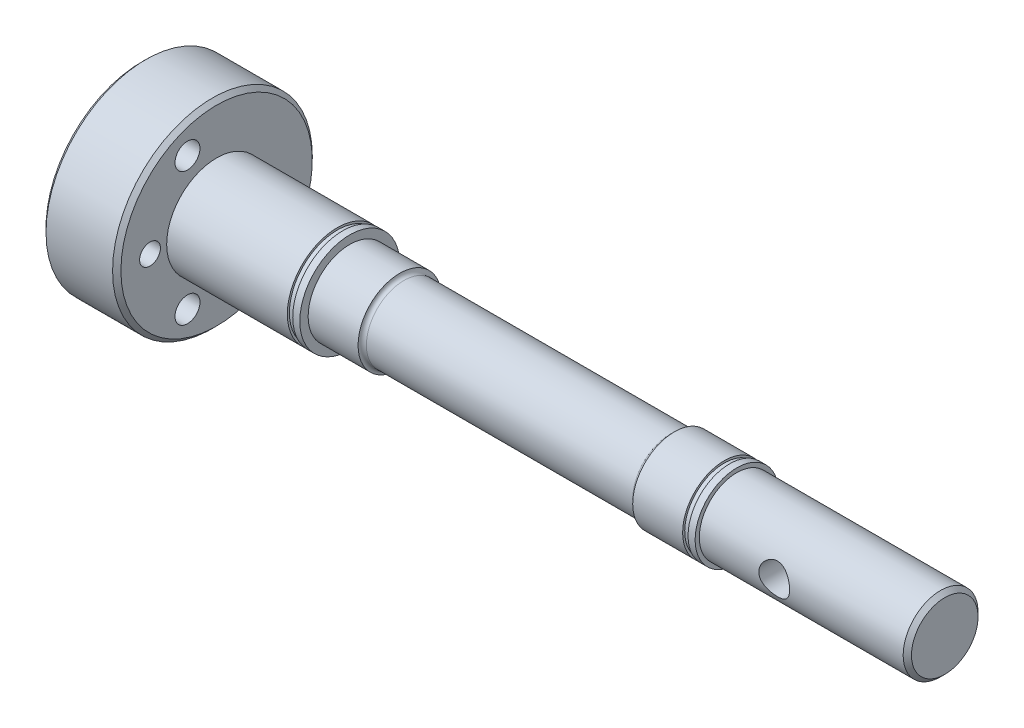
ISO-10303-21;
HEADER;
FILE_DESCRIPTION(('STEP AP214'),'2;1');
FILE_NAME('part.step','',(''),(''),'','','');
FILE_SCHEMA(('AUTOMOTIVE_DESIGN { 1 0 10303 214 1 1 1 1 }'));
ENDSEC;
DATA;
#1=APPLICATION_CONTEXT('core data for automotive mechanical design processes');
#2=APPLICATION_PROTOCOL_DEFINITION('international standard','automotive_design',2000,#1);
#3=PRODUCT_CONTEXT('',#1,'mechanical');
#4=PRODUCT('Part','Part','',(#3));
#5=PRODUCT_RELATED_PRODUCT_CATEGORY('part','',(#4));
#6=PRODUCT_DEFINITION_FORMATION('','',#4);
#7=PRODUCT_DEFINITION_CONTEXT('part definition',#1,'design');
#8=PRODUCT_DEFINITION('design','',#6,#7);
#9=PRODUCT_DEFINITION_SHAPE('','',#8);
#10=(LENGTH_UNIT() NAMED_UNIT(*) SI_UNIT(.MILLI.,.METRE.));
#11=(NAMED_UNIT(*) PLANE_ANGLE_UNIT() SI_UNIT($,.RADIAN.));
#12=(NAMED_UNIT(*) SI_UNIT($,.STERADIAN.) SOLID_ANGLE_UNIT());
#13=UNCERTAINTY_MEASURE_WITH_UNIT(LENGTH_MEASURE(1.E-05),#10,'distance_accuracy_value','');
#14=(GEOMETRIC_REPRESENTATION_CONTEXT(3) GLOBAL_UNCERTAINTY_ASSIGNED_CONTEXT((#13)) GLOBAL_UNIT_ASSIGNED_CONTEXT((#10,
#11,#12)) REPRESENTATION_CONTEXT('',''));
#15=CARTESIAN_POINT('',(0.,0.,0.));
#16=DIRECTION('',(0.,0.,1.));
#17=DIRECTION('',(1.,0.,0.));
#18=AXIS2_PLACEMENT_3D('',#15,#16,#17);
#19=CARTESIAN_POINT('',(-48.7717201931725,0.,0.));
#20=DIRECTION('',(-1.,0.,0.));
#21=DIRECTION('',(0.,0.,1.));
#22=AXIS2_PLACEMENT_3D('',#19,#20,#21);
#23=CYLINDRICAL_SURFACE('',#22,9.99999999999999);
#24=CARTESIAN_POINT('',(128.,0.,0.));
#25=DIRECTION('',(-1.,0.,0.));
#26=DIRECTION('',(0.,0.,1.));
#27=AXIS2_PLACEMENT_3D('',#24,#25,#26);
#28=CIRCLE('',#27,9.99999999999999);
#29=CARTESIAN_POINT('',(128.,0.,9.99999999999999));
#30=VERTEX_POINT('',#29);
#31=EDGE_CURVE('E184',#30,#30,#28,.T.);
#32=ORIENTED_EDGE('',*,*,#31,.F.);
#33=EDGE_LOOP('',(#32));
#34=FACE_BOUND('',#33,.T.);
#35=CARTESIAN_POINT('',(140.,0.,0.));
#36=DIRECTION('',(-1.,0.,0.));
#37=DIRECTION('',(0.,-1.,0.));
#38=AXIS2_PLACEMENT_3D('',#35,#36,#37);
#39=CIRCLE('',#38,9.99999999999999);
#40=CARTESIAN_POINT('',(140.,-9.99999999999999,0.));
#41=VERTEX_POINT('',#40);
#42=EDGE_CURVE('E148',#41,#41,#39,.T.);
#43=ORIENTED_EDGE('',*,*,#42,.T.);
#44=EDGE_LOOP('',(#43));
#45=FACE_BOUND('',#44,.T.);
#46=ADVANCED_FACE('F30',(#34,#45),#23,.T.);
#47=CARTESIAN_POINT('',(-48.7717201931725,0.,0.));
#48=DIRECTION('',(-1.,0.,0.));
#49=DIRECTION('',(0.,0.,1.));
#50=AXIS2_PLACEMENT_3D('',#47,#48,#49);
#51=CYLINDRICAL_SURFACE('',#50,12.);
#52=CARTESIAN_POINT('',(50.,0.,0.));
#53=DIRECTION('',(-1.,0.,0.));
#54=DIRECTION('',(0.,0.,1.));
#55=AXIS2_PLACEMENT_3D('',#52,#53,#54);
#56=CIRCLE('',#55,12.);
#57=CARTESIAN_POINT('',(50.,0.,12.));
#58=VERTEX_POINT('',#57);
#59=EDGE_CURVE('E193',#58,#58,#56,.T.);
#60=ORIENTED_EDGE('',*,*,#59,.T.);
#61=EDGE_LOOP('',(#60));
#62=FACE_BOUND('',#61,.T.);
#63=CARTESIAN_POINT('',(48.3,0.,0.));
#64=DIRECTION('',(-1.,0.,0.));
#65=DIRECTION('',(0.,0.,1.));
#66=AXIS2_PLACEMENT_3D('',#63,#64,#65);
#67=CIRCLE('',#66,12.);
#68=CARTESIAN_POINT('',(48.3,0.,12.));
#69=VERTEX_POINT('',#68);
#70=EDGE_CURVE('E174',#69,#69,#67,.T.);
#71=ORIENTED_EDGE('',*,*,#70,.F.);
#72=EDGE_LOOP('',(#71));
#73=FACE_BOUND('',#72,.T.);
#74=ADVANCED_FACE('F120',(#62,#73),#51,.T.);
#75=CARTESIAN_POINT('',(50.,12.,0.));
#76=DIRECTION('',(-1.,0.,0.));
#77=DIRECTION('',(0.,0.,1.));
#78=AXIS2_PLACEMENT_3D('',#75,#76,#77);
#79=PLANE('',#78);
#80=ORIENTED_EDGE('',*,*,#59,.F.);
#81=EDGE_LOOP('',(#80));
#82=FACE_BOUND('',#81,.T.);
#83=CARTESIAN_POINT('',(50.,0.,0.));
#84=DIRECTION('',(-1.,0.,0.));
#85=DIRECTION('',(0.,0.,1.));
#86=AXIS2_PLACEMENT_3D('',#83,#84,#85);
#87=CIRCLE('',#86,9.99999999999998);
#88=CARTESIAN_POINT('',(50.,0.,9.99999999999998));
#89=VERTEX_POINT('',#88);
#90=EDGE_CURVE('E190',#89,#89,#87,.T.);
#91=ORIENTED_EDGE('',*,*,#90,.T.);
#92=EDGE_LOOP('',(#91));
#93=FACE_BOUND('',#92,.T.);
#94=ADVANCED_FACE('F127',(#82,#93),#79,.F.);
#95=CARTESIAN_POINT('',(-48.7717201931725,0.,0.));
#96=DIRECTION('',(-1.,0.,0.));
#97=DIRECTION('',(0.,0.,1.));
#98=AXIS2_PLACEMENT_3D('',#95,#96,#97);
#99=CYLINDRICAL_SURFACE('',#98,9.99999999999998);
#100=ORIENTED_EDGE('',*,*,#90,.F.);
#101=EDGE_LOOP('',(#100));
#102=FACE_BOUND('',#101,.T.);
#103=CARTESIAN_POINT('',(62.,0.,0.));
#104=DIRECTION('',(-1.,0.,0.));
#105=DIRECTION('',(0.,0.,1.));
#106=AXIS2_PLACEMENT_3D('',#103,#104,#105);
#107=CIRCLE('',#106,9.99999999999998);
#108=CARTESIAN_POINT('',(62.,0.,9.99999999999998));
#109=VERTEX_POINT('',#108);
#110=EDGE_CURVE('E187',#109,#109,#107,.T.);
#111=ORIENTED_EDGE('',*,*,#110,.T.);
#112=EDGE_LOOP('',(#111));
#113=FACE_BOUND('',#112,.T.);
#114=ADVANCED_FACE('F346',(#102,#113),#99,.T.);
#115=CARTESIAN_POINT('',(-48.7717201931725,0.,0.));
#116=DIRECTION('',(-1.,0.,0.));
#117=DIRECTION('',(0.,0.,1.));
#118=AXIS2_PLACEMENT_3D('',#115,#116,#117);
#119=CYLINDRICAL_SURFACE('',#118,8.99999999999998);
#120=CARTESIAN_POINT('',(127.,0.,0.));
#121=DIRECTION('',(1.,0.,0.));
#122=DIRECTION('',(0.,0.,-1.));
#123=AXIS2_PLACEMENT_3D('',#120,#121,#122);
#124=CIRCLE('',#123,8.99999999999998);
#125=CARTESIAN_POINT('',(127.,0.,-8.99999999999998));
#126=VERTEX_POINT('',#125);
#127=EDGE_CURVE('E202',#126,#126,#124,.F.);
#128=ORIENTED_EDGE('',*,*,#127,.T.);
#129=EDGE_LOOP('',(#128));
#130=FACE_BOUND('',#129,.T.);
#131=CARTESIAN_POINT('',(63.,0.,0.));
#132=DIRECTION('',(-1.,0.,0.));
#133=DIRECTION('',(0.,0.,1.));
#134=AXIS2_PLACEMENT_3D('',#131,#132,#133);
#135=CIRCLE('',#134,8.99999999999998);
#136=CARTESIAN_POINT('',(63.,0.,8.99999999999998));
#137=VERTEX_POINT('',#136);
#138=EDGE_CURVE('E199',#137,#137,#135,.F.);
#139=ORIENTED_EDGE('',*,*,#138,.T.);
#140=EDGE_LOOP('',(#139));
#141=FACE_BOUND('',#140,.T.);
#142=ADVANCED_FACE('F106',(#130,#141),#119,.T.);
#143=CARTESIAN_POINT('',(47.,11.5,0.));
#144=DIRECTION('',(1.,0.,0.));
#145=DIRECTION('',(0.,0.,-1.));
#146=AXIS2_PLACEMENT_3D('',#143,#144,#145);
#147=PLANE('',#146);
#148=CARTESIAN_POINT('',(47.,0.,0.));
#149=DIRECTION('',(-1.,0.,0.));
#150=DIRECTION('',(0.,0.,1.));
#151=AXIS2_PLACEMENT_3D('',#148,#149,#150);
#152=CIRCLE('',#151,11.5);
#153=CARTESIAN_POINT('',(47.,0.,11.5));
#154=VERTEX_POINT('',#153);
#155=EDGE_CURVE('E168',#154,#154,#152,.T.);
#156=ORIENTED_EDGE('',*,*,#155,.T.);
#157=EDGE_LOOP('',(#156));
#158=FACE_BOUND('',#157,.T.);
#159=CARTESIAN_POINT('',(47.,0.,0.));
#160=DIRECTION('',(-1.,0.,0.));
#161=DIRECTION('',(0.,0.,1.));
#162=AXIS2_PLACEMENT_3D('',#159,#160,#161);
#163=CIRCLE('',#162,12.);
#164=CARTESIAN_POINT('',(47.,0.,12.));
#165=VERTEX_POINT('',#164);
#166=EDGE_CURVE('E177',#165,#165,#163,.T.);
#167=ORIENTED_EDGE('',*,*,#166,.F.);
#168=EDGE_LOOP('',(#167));
#169=FACE_BOUND('',#168,.T.);
#170=ADVANCED_FACE('F102',(#158,#169),#147,.T.);
#171=CARTESIAN_POINT('',(48.3,11.5,0.));
#172=DIRECTION('',(-1.,0.,0.));
#173=DIRECTION('',(0.,0.,1.));
#174=AXIS2_PLACEMENT_3D('',#171,#172,#173);
#175=PLANE('',#174);
#176=ORIENTED_EDGE('',*,*,#70,.T.);
#177=EDGE_LOOP('',(#176));
#178=FACE_BOUND('',#177,.T.);
#179=CARTESIAN_POINT('',(48.3,0.,0.));
#180=DIRECTION('',(-1.,0.,0.));
#181=DIRECTION('',(0.,0.,1.));
#182=AXIS2_PLACEMENT_3D('',#179,#180,#181);
#183=CIRCLE('',#182,11.5);
#184=CARTESIAN_POINT('',(48.3,0.,11.5));
#185=VERTEX_POINT('',#184);
#186=EDGE_CURVE('E171',#185,#185,#183,.T.);
#187=ORIENTED_EDGE('',*,*,#186,.F.);
#188=EDGE_LOOP('',(#187));
#189=FACE_BOUND('',#188,.T.);
#190=ADVANCED_FACE('F98',(#178,#189),#175,.T.);
#191=CARTESIAN_POINT('',(0.,0.,0.));
#192=DIRECTION('',(-1.,0.,0.));
#193=DIRECTION('',(0.,0.,1.));
#194=AXIS2_PLACEMENT_3D('',#191,#192,#193);
#195=CYLINDRICAL_SURFACE('',#194,11.5);
#196=ORIENTED_EDGE('',*,*,#186,.T.);
#197=EDGE_LOOP('',(#196));
#198=FACE_BOUND('',#197,.T.);
#199=ORIENTED_EDGE('',*,*,#155,.F.);
#200=EDGE_LOOP('',(#199));
#201=FACE_BOUND('',#200,.T.);
#202=ADVANCED_FACE('F94',(#198,#201),#195,.T.);
#203=CARTESIAN_POINT('',(0.,0.,0.));
#204=DIRECTION('',(1.,0.,0.));
#205=DIRECTION('',(0.,0.,-1.));
#206=AXIS2_PLACEMENT_3D('',#203,#204,#205);
#207=PLANE('',#206);
#208=CARTESIAN_POINT('',(0.,0.,16.));
#209=DIRECTION('',(-1.,0.,0.));
#210=DIRECTION('',(0.,0.,1.));
#211=AXIS2_PLACEMENT_3D('',#208,#209,#210);
#212=CIRCLE('',#211,2.5);
#213=CARTESIAN_POINT('',(0.,0.,18.5));
#214=VERTEX_POINT('',#213);
#215=EDGE_CURVE('E152',#214,#214,#212,.T.);
#216=ORIENTED_EDGE('',*,*,#215,.F.);
#217=EDGE_LOOP('',(#216));
#218=FACE_BOUND('',#217,.T.);
#219=CARTESIAN_POINT('',(0.,-16.,7.));
#220=DIRECTION('',(-1.,0.,0.));
#221=DIRECTION('',(0.,0.,1.));
#222=AXIS2_PLACEMENT_3D('',#219,#220,#221);
#223=CIRCLE('',#222,3.);
#224=CARTESIAN_POINT('',(0.,-16.,10.));
#225=VERTEX_POINT('',#224);
#226=EDGE_CURVE('E161',#225,#225,#223,.T.);
#227=ORIENTED_EDGE('',*,*,#226,.F.);
#228=EDGE_LOOP('',(#227));
#229=FACE_BOUND('',#228,.T.);
#230=CARTESIAN_POINT('',(0.,16.,7.));
#231=DIRECTION('',(-1.,0.,0.));
#232=DIRECTION('',(0.,0.,1.));
#233=AXIS2_PLACEMENT_3D('',#230,#231,#232);
#234=CIRCLE('',#233,3.);
#235=CARTESIAN_POINT('',(0.,16.,10.));
#236=VERTEX_POINT('',#235);
#237=EDGE_CURVE('E165',#236,#236,#234,.T.);
#238=ORIENTED_EDGE('',*,*,#237,.F.);
#239=EDGE_LOOP('',(#238));
#240=FACE_BOUND('',#239,.T.);
#241=CARTESIAN_POINT('',(0.,0.,0.));
#242=DIRECTION('',(1.,0.,0.));
#243=DIRECTION('',(0.,0.,-1.));
#244=AXIS2_PLACEMENT_3D('',#241,#242,#243);
#245=CIRCLE('',#244,23.);
#246=CARTESIAN_POINT('',(0.,0.,-23.));
#247=VERTEX_POINT('',#246);
#248=EDGE_CURVE('E10',#247,#247,#245,.F.);
#249=ORIENTED_EDGE('',*,*,#248,.T.);
#250=EDGE_LOOP('',(#249));
#251=FACE_BOUND('',#250,.T.);
#252=ADVANCED_FACE('F97',(#218,#229,#240,#251),#207,.F.);
#253=CARTESIAN_POINT('',(-48.7717201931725,0.,0.));
#254=DIRECTION('',(-1.,0.,0.));
#255=DIRECTION('',(0.,0.,1.));
#256=AXIS2_PLACEMENT_3D('',#253,#254,#255);
#257=CYLINDRICAL_SURFACE('',#256,24.);
#258=CARTESIAN_POINT('',(17.,0.,0.));
#259=DIRECTION('',(-1.,0.,0.));
#260=DIRECTION('',(0.,0.,1.));
#261=AXIS2_PLACEMENT_3D('',#258,#259,#260);
#262=CIRCLE('',#261,24.);
#263=CARTESIAN_POINT('',(17.,0.,24.));
#264=VERTEX_POINT('',#263);
#265=EDGE_CURVE('E208',#264,#264,#262,.T.);
#266=ORIENTED_EDGE('',*,*,#265,.T.);
#267=EDGE_LOOP('',(#266));
#268=FACE_BOUND('',#267,.T.);
#269=CARTESIAN_POINT('',(1.00000000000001,0.,0.));
#270=DIRECTION('',(1.,0.,0.));
#271=DIRECTION('',(0.,0.,-1.));
#272=AXIS2_PLACEMENT_3D('',#269,#270,#271);
#273=CIRCLE('',#272,24.);
#274=CARTESIAN_POINT('',(1.00000000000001,0.,-24.));
#275=VERTEX_POINT('',#274);
#276=EDGE_CURVE('E205',#275,#275,#273,.T.);
#277=ORIENTED_EDGE('',*,*,#276,.T.);
#278=EDGE_LOOP('',(#277));
#279=FACE_BOUND('',#278,.T.);
#280=ADVANCED_FACE('F32',(#268,#279),#257,.T.);
#281=CARTESIAN_POINT('',(18.,24.,0.));
#282=DIRECTION('',(-1.,0.,0.));
#283=DIRECTION('',(0.,0.,1.));
#284=AXIS2_PLACEMENT_3D('',#281,#282,#283);
#285=PLANE('',#284);
#286=CARTESIAN_POINT('',(18.,0.,16.));
#287=DIRECTION('',(-1.,0.,0.));
#288=DIRECTION('',(0.,0.,1.));
#289=AXIS2_PLACEMENT_3D('',#286,#287,#288);
#290=CIRCLE('',#289,2.5);
#291=CARTESIAN_POINT('',(18.,0.,18.5));
#292=VERTEX_POINT('',#291);
#293=EDGE_CURVE('E34',#292,#292,#290,.T.);
#294=ORIENTED_EDGE('',*,*,#293,.T.);
#295=EDGE_LOOP('',(#294));
#296=FACE_BOUND('',#295,.T.);
#297=CARTESIAN_POINT('',(18.,-16.,7.));
#298=DIRECTION('',(-1.,0.,0.));
#299=DIRECTION('',(0.,0.,1.));
#300=AXIS2_PLACEMENT_3D('',#297,#298,#299);
#301=CIRCLE('',#300,3.);
#302=CARTESIAN_POINT('',(18.,-16.,10.));
#303=VERTEX_POINT('',#302);
#304=EDGE_CURVE('E164',#303,#303,#301,.T.);
#305=ORIENTED_EDGE('',*,*,#304,.T.);
#306=EDGE_LOOP('',(#305));
#307=FACE_BOUND('',#306,.T.);
#308=CARTESIAN_POINT('',(18.,16.,7.));
#309=DIRECTION('',(-1.,0.,0.));
#310=DIRECTION('',(0.,0.,1.));
#311=AXIS2_PLACEMENT_3D('',#308,#309,#310);
#312=CIRCLE('',#311,3.);
#313=CARTESIAN_POINT('',(18.,16.,10.));
#314=VERTEX_POINT('',#313);
#315=EDGE_CURVE('E55',#314,#314,#312,.T.);
#316=ORIENTED_EDGE('',*,*,#315,.T.);
#317=EDGE_LOOP('',(#316));
#318=FACE_BOUND('',#317,.T.);
#319=CARTESIAN_POINT('',(18.,0.,0.));
#320=DIRECTION('',(-1.,0.,0.));
#321=DIRECTION('',(0.,0.,1.));
#322=AXIS2_PLACEMENT_3D('',#319,#320,#321);
#323=CIRCLE('',#322,23.);
#324=CARTESIAN_POINT('',(18.,0.,23.));
#325=VERTEX_POINT('',#324);
#326=EDGE_CURVE('E211',#325,#325,#323,.F.);
#327=ORIENTED_EDGE('',*,*,#326,.T.);
#328=EDGE_LOOP('',(#327));
#329=FACE_BOUND('',#328,.T.);
#330=CARTESIAN_POINT('',(18.,0.,0.));
#331=DIRECTION('',(-1.,0.,0.));
#332=DIRECTION('',(0.,0.,1.));
#333=AXIS2_PLACEMENT_3D('',#330,#331,#332);
#334=CIRCLE('',#333,12.);
#335=CARTESIAN_POINT('',(18.,0.,12.));
#336=VERTEX_POINT('',#335);
#337=EDGE_CURVE('E196',#336,#336,#334,.T.);
#338=ORIENTED_EDGE('',*,*,#337,.T.);
#339=EDGE_LOOP('',(#338));
#340=FACE_BOUND('',#339,.T.);
#341=ADVANCED_FACE('F324',(#296,#307,#318,#329,#340),#285,.F.);
#342=ORIENTED_EDGE('',*,*,#337,.F.);
#343=EDGE_LOOP('',(#342));
#344=FACE_BOUND('',#343,.T.);
#345=ORIENTED_EDGE('',*,*,#166,.T.);
#346=EDGE_LOOP('',(#345));
#347=FACE_BOUND('',#346,.T.);
#348=ADVANCED_FACE('F92',(#344,#347),#51,.T.);
#349=CARTESIAN_POINT('',(127.,0.,0.));
#350=DIRECTION('',(1.,0.,0.));
#351=DIRECTION('',(0.,0.,-1.));
#352=AXIS2_PLACEMENT_3D('',#349,#350,#351);
#353=TOROIDAL_SURFACE('',#352,9.99999999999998,1.);
#354=ORIENTED_EDGE('',*,*,#31,.T.);
#355=EDGE_LOOP('',(#354));
#356=FACE_BOUND('',#355,.T.);
#357=ORIENTED_EDGE('',*,*,#127,.F.);
#358=EDGE_LOOP('',(#357));
#359=FACE_BOUND('',#358,.T.);
#360=ADVANCED_FACE('F88',(#356,#359),#353,.F.);
#361=CARTESIAN_POINT('',(63.,0.,0.));
#362=DIRECTION('',(-1.,0.,0.));
#363=DIRECTION('',(0.,0.,1.));
#364=AXIS2_PLACEMENT_3D('',#361,#362,#363);
#365=TOROIDAL_SURFACE('',#364,9.99999999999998,1.);
#366=ORIENTED_EDGE('',*,*,#138,.F.);
#367=EDGE_LOOP('',(#366));
#368=FACE_BOUND('',#367,.T.);
#369=ORIENTED_EDGE('',*,*,#110,.F.);
#370=EDGE_LOOP('',(#369));
#371=FACE_BOUND('',#370,.T.);
#372=ADVANCED_FACE('F84',(#368,#371),#365,.F.);
#373=CARTESIAN_POINT('',(17.,0.,0.));
#374=DIRECTION('',(-1.,0.,0.));
#375=DIRECTION('',(0.,0.,1.));
#376=AXIS2_PLACEMENT_3D('',#373,#374,#375);
#377=CONICAL_SURFACE('',#376,24.,0.78539816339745);
#378=ORIENTED_EDGE('',*,*,#326,.F.);
#379=EDGE_LOOP('',(#378));
#380=FACE_BOUND('',#379,.T.);
#381=ORIENTED_EDGE('',*,*,#265,.F.);
#382=EDGE_LOOP('',(#381));
#383=FACE_BOUND('',#382,.T.);
#384=ADVANCED_FACE('F76',(#380,#383),#377,.T.);
#385=CARTESIAN_POINT('',(0.,0.,0.));
#386=DIRECTION('',(1.,0.,0.));
#387=DIRECTION('',(0.,0.,-1.));
#388=AXIS2_PLACEMENT_3D('',#385,#386,#387);
#389=CONICAL_SURFACE('',#388,23.,0.785398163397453);
#390=ORIENTED_EDGE('',*,*,#276,.F.);
#391=EDGE_LOOP('',(#390));
#392=FACE_BOUND('',#391,.T.);
#393=ORIENTED_EDGE('',*,*,#248,.F.);
#394=EDGE_LOOP('',(#393));
#395=FACE_BOUND('',#394,.T.);
#396=ADVANCED_FACE('F72',(#392,#395),#389,.T.);
#397=CARTESIAN_POINT('',(193.,16.,7.));
#398=DIRECTION('',(-1.,0.,0.));
#399=DIRECTION('',(0.,0.,1.));
#400=AXIS2_PLACEMENT_3D('',#397,#398,#399);
#401=CYLINDRICAL_SURFACE('',#400,3.);
#402=ORIENTED_EDGE('',*,*,#237,.T.);
#403=EDGE_LOOP('',(#402));
#404=FACE_BOUND('',#403,.T.);
#405=ORIENTED_EDGE('',*,*,#315,.F.);
#406=EDGE_LOOP('',(#405));
#407=FACE_BOUND('',#406,.T.);
#408=ADVANCED_FACE('F70',(#404,#407),#401,.F.);
#409=CARTESIAN_POINT('',(193.,-16.,7.));
#410=DIRECTION('',(-1.,0.,0.));
#411=DIRECTION('',(0.,0.,1.));
#412=AXIS2_PLACEMENT_3D('',#409,#410,#411);
#413=CYLINDRICAL_SURFACE('',#412,3.);
#414=ORIENTED_EDGE('',*,*,#226,.T.);
#415=EDGE_LOOP('',(#414));
#416=FACE_BOUND('',#415,.T.);
#417=ORIENTED_EDGE('',*,*,#304,.F.);
#418=EDGE_LOOP('',(#417));
#419=FACE_BOUND('',#418,.T.);
#420=ADVANCED_FACE('F302',(#416,#419),#413,.F.);
#421=CARTESIAN_POINT('',(193.,0.,16.));
#422=DIRECTION('',(-1.,0.,0.));
#423=DIRECTION('',(0.,0.,1.));
#424=AXIS2_PLACEMENT_3D('',#421,#422,#423);
#425=CYLINDRICAL_SURFACE('',#424,2.5);
#426=ORIENTED_EDGE('',*,*,#215,.T.);
#427=EDGE_LOOP('',(#426));
#428=FACE_BOUND('',#427,.T.);
#429=ORIENTED_EDGE('',*,*,#293,.F.);
#430=EDGE_LOOP('',(#429));
#431=FACE_BOUND('',#430,.T.);
#432=ADVANCED_FACE('F246',(#428,#431),#425,.F.);
#433=CARTESIAN_POINT('',(140.,9.49999999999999,0.));
#434=DIRECTION('',(1.,0.,0.));
#435=DIRECTION('',(0.,1.,0.));
#436=AXIS2_PLACEMENT_3D('',#433,#434,#435);
#437=PLANE('',#436);
#438=CARTESIAN_POINT('',(140.,0.,0.));
#439=DIRECTION('',(-1.,0.,0.));
#440=DIRECTION('',(0.,-1.,0.));
#441=AXIS2_PLACEMENT_3D('',#438,#439,#440);
#442=CIRCLE('',#441,9.49999999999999);
#443=CARTESIAN_POINT('',(140.,-9.49999999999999,0.));
#444=VERTEX_POINT('',#443);
#445=EDGE_CURVE('E155',#444,#444,#442,.T.);
#446=ORIENTED_EDGE('',*,*,#445,.T.);
#447=EDGE_LOOP('',(#446));
#448=FACE_BOUND('',#447,.T.);
#449=ORIENTED_EDGE('',*,*,#42,.F.);
#450=EDGE_LOOP('',(#449));
#451=FACE_BOUND('',#450,.T.);
#452=ADVANCED_FACE('F256',(#448,#451),#437,.T.);
#453=CARTESIAN_POINT('',(141.3,9.49999999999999,0.));
#454=DIRECTION('',(-1.,0.,0.));
#455=DIRECTION('',(0.,-1.,0.));
#456=AXIS2_PLACEMENT_3D('',#453,#454,#455);
#457=PLANE('',#456);
#458=CARTESIAN_POINT('',(141.3,0.,0.));
#459=DIRECTION('',(-1.,0.,0.));
#460=DIRECTION('',(0.,-1.,0.));
#461=AXIS2_PLACEMENT_3D('',#458,#459,#460);
#462=CIRCLE('',#461,9.99999999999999);
#463=CARTESIAN_POINT('',(141.3,-9.99999999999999,0.));
#464=VERTEX_POINT('',#463);
#465=EDGE_CURVE('E146',#464,#464,#462,.T.);
#466=ORIENTED_EDGE('',*,*,#465,.T.);
#467=EDGE_LOOP('',(#466));
#468=FACE_BOUND('',#467,.T.);
#469=CARTESIAN_POINT('',(141.3,0.,0.));
#470=DIRECTION('',(-1.,0.,0.));
#471=DIRECTION('',(0.,-1.,0.));
#472=AXIS2_PLACEMENT_3D('',#469,#470,#471);
#473=CIRCLE('',#472,9.49999999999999);
#474=CARTESIAN_POINT('',(141.3,-9.49999999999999,0.));
#475=VERTEX_POINT('',#474);
#476=EDGE_CURVE('E149',#475,#475,#473,.T.);
#477=ORIENTED_EDGE('',*,*,#476,.F.);
#478=EDGE_LOOP('',(#477));
#479=FACE_BOUND('',#478,.T.);
#480=ADVANCED_FACE('F116',(#468,#479),#457,.T.);
#481=CARTESIAN_POINT('',(141.562186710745,0.,0.));
#482=DIRECTION('',(-1.,0.,0.));
#483=DIRECTION('',(0.,-1.,0.));
#484=AXIS2_PLACEMENT_3D('',#481,#482,#483);
#485=CYLINDRICAL_SURFACE('',#484,9.49999999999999);
#486=ORIENTED_EDGE('',*,*,#476,.T.);
#487=EDGE_LOOP('',(#486));
#488=FACE_BOUND('',#487,.T.);
#489=ORIENTED_EDGE('',*,*,#445,.F.);
#490=EDGE_LOOP('',(#489));
#491=FACE_BOUND('',#490,.T.);
#492=ADVANCED_FACE('F111',(#488,#491),#485,.T.);
#493=CARTESIAN_POINT('',(193.,8.99999999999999,0.));
#494=DIRECTION('',(-1.,0.,0.));
#495=DIRECTION('',(0.,0.,1.));
#496=AXIS2_PLACEMENT_3D('',#493,#494,#495);
#497=PLANE('',#496);
#498=CARTESIAN_POINT('',(193.,0.,0.));
#499=DIRECTION('',(-1.,0.,0.));
#500=DIRECTION('',(0.,0.,1.));
#501=AXIS2_PLACEMENT_3D('',#498,#499,#500);
#502=CIRCLE('',#501,7.99999999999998);
#503=CARTESIAN_POINT('',(193.,0.,7.99999999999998));
#504=VERTEX_POINT('',#503);
#505=EDGE_CURVE('E38',#504,#504,#502,.F.);
#506=ORIENTED_EDGE('',*,*,#505,.T.);
#507=EDGE_LOOP('',(#506));
#508=FACE_BOUND('',#507,.T.);
#509=ADVANCED_FACE('F80',(#508),#497,.F.);
#510=CARTESIAN_POINT('',(192.,0.,0.));
#511=DIRECTION('',(-1.,0.,0.));
#512=DIRECTION('',(0.,0.,1.));
#513=AXIS2_PLACEMENT_3D('',#510,#511,#512);
#514=CONICAL_SURFACE('',#513,8.99999999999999,0.785398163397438);
#515=ORIENTED_EDGE('',*,*,#505,.F.);
#516=EDGE_LOOP('',(#515));
#517=FACE_BOUND('',#516,.T.);
#518=CARTESIAN_POINT('',(192.,0.,0.));
#519=DIRECTION('',(-1.,0.,0.));
#520=DIRECTION('',(0.,0.,1.));
#521=AXIS2_PLACEMENT_3D('',#518,#519,#520);
#522=CIRCLE('',#521,8.99999999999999);
#523=CARTESIAN_POINT('',(192.,0.,8.99999999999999));
#524=VERTEX_POINT('',#523);
#525=EDGE_CURVE('E43',#524,#524,#522,.T.);
#526=ORIENTED_EDGE('',*,*,#525,.F.);
#527=EDGE_LOOP('',(#526));
#528=FACE_BOUND('',#527,.T.);
#529=ADVANCED_FACE('F68',(#517,#528),#514,.T.);
#530=CARTESIAN_POINT('',(161.,0.,-10.));
#531=DIRECTION('',(0.,0.,1.));
#532=DIRECTION('',(1.,0.,0.));
#533=AXIS2_PLACEMENT_3D('',#530,#531,#532);
#534=CYLINDRICAL_SURFACE('',#533,3.70000000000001);
#535=CARTESIAN_POINT('',(164.7,0.,-8.99999999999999));
#536=CARTESIAN_POINT('',(164.699999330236,0.0992525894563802,-8.99999947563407));
#537=CARTESIAN_POINT('',(164.696000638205,0.198540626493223,-8.99835351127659));
#538=CARTESIAN_POINT('',(164.680043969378,0.396409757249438,-8.99181141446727));
#539=CARTESIAN_POINT('',(164.668080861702,0.494990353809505,-8.98691318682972));
#540=CARTESIAN_POINT('',(164.636280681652,0.690885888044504,-8.97398037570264));
#541=CARTESIAN_POINT('',(164.616427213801,0.788197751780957,-8.96593926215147));
#542=CARTESIAN_POINT('',(164.569054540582,0.980658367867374,-8.94693733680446));
#543=CARTESIAN_POINT('',(164.541532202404,1.07580621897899,-8.93597533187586));
#544=CARTESIAN_POINT('',(164.448056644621,1.35630592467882,-8.89920006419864));
#545=CARTESIAN_POINT('',(164.371049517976,1.53759526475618,-8.8694356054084));
#546=CARTESIAN_POINT('',(164.190187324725,1.88441745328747,-8.80228838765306));
#547=CARTESIAN_POINT('',(164.086340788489,2.04995528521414,-8.76490805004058));
#548=CARTESIAN_POINT('',(163.849321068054,2.36909351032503,-8.68421967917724));
#549=CARTESIAN_POINT('',(163.715040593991,2.52182434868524,-8.64072086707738));
#550=CARTESIAN_POINT('',(163.42331219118,2.80333580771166,-8.55354182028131));
#551=CARTESIAN_POINT('',(163.265852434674,2.9321041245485,-8.50986150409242));
#552=CARTESIAN_POINT('',(162.923140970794,3.16809467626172,-8.42494321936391));
#553=CARTESIAN_POINT('',(162.736923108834,3.2739994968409,-8.38392048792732));
#554=CARTESIAN_POINT('',(162.347383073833,3.45259365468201,-8.31197555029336));
#555=CARTESIAN_POINT('',(162.144069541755,3.52529965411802,-8.28104827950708));
#556=CARTESIAN_POINT('',(161.736127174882,3.63186218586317,-8.23485431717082));
#557=CARTESIAN_POINT('',(161.532014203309,3.66739173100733,-8.21891683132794));
#558=CARTESIAN_POINT('',(161.120149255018,3.70381460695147,-8.20257265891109));
#559=CARTESIAN_POINT('',(160.912399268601,3.70472632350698,-8.20215772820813));
#560=CARTESIAN_POINT('',(160.515619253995,3.67315042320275,-8.21633630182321));
#561=CARTESIAN_POINT('',(160.326344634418,3.64313775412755,-8.22981768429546));
#562=CARTESIAN_POINT('',(159.955803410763,3.55470808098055,-8.26839480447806));
#563=CARTESIAN_POINT('',(159.774538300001,3.49628580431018,-8.29349269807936));
#564=CARTESIAN_POINT('',(159.420650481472,3.35156426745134,-8.35303698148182));
#565=CARTESIAN_POINT('',(159.248289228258,3.26470531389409,-8.38766863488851));
#566=CARTESIAN_POINT('',(158.919930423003,3.06597074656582,-8.46233256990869));
#567=CARTESIAN_POINT('',(158.763939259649,2.95408541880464,-8.50236694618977));
#568=CARTESIAN_POINT('',(158.459275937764,2.69769052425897,-8.58732399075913));
#569=CARTESIAN_POINT('',(158.3122549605,2.5512571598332,-8.63237819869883));
#570=CARTESIAN_POINT('',(158.044311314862,2.23535498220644,-8.71951922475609));
#571=CARTESIAN_POINT('',(157.923394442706,2.06588106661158,-8.76160538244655));
#572=CARTESIAN_POINT('',(157.708757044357,1.70380391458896,-8.83923235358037));
#573=CARTESIAN_POINT('',(157.615691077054,1.51077496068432,-8.87460938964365));
#574=CARTESIAN_POINT('',(157.463928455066,1.10997574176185,-8.93358158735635));
#575=CARTESIAN_POINT('',(157.405213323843,0.902213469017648,-8.95718308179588));
#576=CARTESIAN_POINT('',(157.327235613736,0.49165819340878,-8.98877167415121));
#577=CARTESIAN_POINT('',(157.305756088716,0.289353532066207,-8.99763479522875));
#578=CARTESIAN_POINT('',(157.296271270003,-0.116146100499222,-9.0015318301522));
#579=CARTESIAN_POINT('',(157.30825668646,-0.319340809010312,-8.99656958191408));
#580=CARTESIAN_POINT('',(157.363759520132,-0.710583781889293,-8.97394354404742));
#581=CARTESIAN_POINT('',(157.405734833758,-0.898890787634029,-8.95690124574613));
#582=CARTESIAN_POINT('',(157.517895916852,-1.2655948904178,-8.91248603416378));
#583=CARTESIAN_POINT('',(157.588085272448,-1.44399072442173,-8.88511180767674));
#584=CARTESIAN_POINT('',(157.756976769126,-1.79203094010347,-8.82161556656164));
#585=CARTESIAN_POINT('',(157.85649380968,-1.96123385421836,-8.78524912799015));
#586=CARTESIAN_POINT('',(158.080317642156,-2.28114102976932,-8.70767102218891));
#587=CARTESIAN_POINT('',(158.204634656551,-2.431837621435,-8.66645735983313));
#588=CARTESIAN_POINT('',(158.484667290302,-2.72147866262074,-8.58009116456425));
#589=CARTESIAN_POINT('',(158.641966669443,-2.85887370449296,-8.53486421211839));
#590=CARTESIAN_POINT('',(158.978138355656,-3.10573189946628,-8.44817085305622));
#591=CARTESIAN_POINT('',(159.157015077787,-3.21518932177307,-8.40670521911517));
#592=CARTESIAN_POINT('',(159.534608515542,-3.40407436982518,-8.33203281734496));
#593=CARTESIAN_POINT('',(159.733547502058,-3.48310477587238,-8.29893711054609));
#594=CARTESIAN_POINT('',(160.143692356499,-3.60589300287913,-8.2463374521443));
#595=CARTESIAN_POINT('',(160.354888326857,-3.64967887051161,-8.22682269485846));
#596=CARTESIAN_POINT('',(160.76640952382,-3.69798350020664,-8.20521502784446));
#597=CARTESIAN_POINT('',(160.966355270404,-3.70521165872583,-8.20192052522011));
#598=CARTESIAN_POINT('',(161.364483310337,-3.68738909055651,-8.20994878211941));
#599=CARTESIAN_POINT('',(161.562665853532,-3.66234301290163,-8.22126943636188));
#600=CARTESIAN_POINT('',(161.942648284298,-3.58293836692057,-8.25616686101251));
#601=CARTESIAN_POINT('',(162.124785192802,-3.52992195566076,-8.27918079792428));
#602=CARTESIAN_POINT('',(162.477631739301,-3.39737377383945,-8.33444535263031));
#603=CARTESIAN_POINT('',(162.648338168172,-3.31783459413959,-8.36669855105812));
#604=CARTESIAN_POINT('',(162.984501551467,-3.12907159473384,-8.43917634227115));
#605=CARTESIAN_POINT('',(163.149049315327,-3.01836907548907,-8.47975983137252));
#606=CARTESIAN_POINT('',(163.458084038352,-2.7725136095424,-8.56329381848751));
#607=CARTESIAN_POINT('',(163.602564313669,-2.6373525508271,-8.60624509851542));
#608=CARTESIAN_POINT('',(163.877761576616,-2.33519416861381,-8.69328932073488));
#609=CARTESIAN_POINT('',(164.006803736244,-2.16662928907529,-8.73725122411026));
#610=CARTESIAN_POINT('',(164.23487371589,-1.80847605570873,-8.81833299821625));
#611=CARTESIAN_POINT('',(164.333887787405,-1.61887812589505,-8.8554497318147));
#612=CARTESIAN_POINT('',(164.456398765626,-1.32453888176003,-8.90254665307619));
#613=CARTESIAN_POINT('',(164.492705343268,-1.22562345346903,-8.91673325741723));
#614=CARTESIAN_POINT('',(164.5568323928,-1.02471379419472,-8.94204560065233));
#615=CARTESIAN_POINT('',(164.584656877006,-0.922721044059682,-8.9531727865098));
#616=CARTESIAN_POINT('',(164.6314576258,-0.716696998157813,-8.97201364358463));
#617=CARTESIAN_POINT('',(164.650455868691,-0.612671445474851,-8.9797357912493));
#618=CARTESIAN_POINT('',(164.679479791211,-0.403223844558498,-8.99157347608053));
#619=CARTESIAN_POINT('',(164.689512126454,-0.297802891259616,-8.99569168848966));
#620=CARTESIAN_POINT('',(164.696671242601,-0.160156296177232,-8.99863199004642));
#621=CARTESIAN_POINT('',(164.697919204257,-0.128141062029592,-8.99914473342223));
#622=CARTESIAN_POINT('',(164.699583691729,-0.0640851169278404,-8.99982882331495));
#623=CARTESIAN_POINT('',(164.700000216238,-0.0320444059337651,-9.00000016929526));
#624=CARTESIAN_POINT('',(164.7,0.,-8.99999999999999));
#625=B_SPLINE_CURVE_WITH_KNOTS('',3,(#535,#536,#537,#538,#539,#540,#541,#542,#543,#544,#545,
#546,#547,#548,#549,#550,#551,#552,#553,#554,#555,#556,#557,#558,#559,#560,#561,#562,#563,#564,
#565,#566,#567,#568,#569,#570,#571,#572,#573,#574,#575,#576,#577,#578,#579,#580,#581,#582,#583,
#584,#585,#586,#587,#588,#589,#590,#591,#592,#593,#594,#595,#596,#597,#598,#599,#600,#601,#602,
#603,#604,#605,#606,#607,#608,#609,#610,#611,#612,#613,#614,#615,#616,#617,#618,#619,#620,#621,
#622,#623,#624),.UNSPECIFIED.,.T.,.F.,(4,2,2,2,2,2,2,2,2,2,2,2,2,2,2,2,2,2,2,2,2,2,2,2,2,2,2,2,
2,2,2,2,2,2,2,2,2,2,2,2,2,2,2,2,4),(0.,0.297724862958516,0.595641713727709,0.894180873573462,
1.19284216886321,1.78751258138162,2.38199422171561,3.00316449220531,3.62465283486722,
4.27572517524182,4.92647038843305,5.5464740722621,6.16614846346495,6.73981065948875,
7.31357936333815,7.89939813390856,8.48544468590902,9.11958513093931,9.75386623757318,
10.4020569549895,11.049898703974,11.6576429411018,12.2652184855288,12.8436126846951,
13.4220804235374,14.0184436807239,14.6150532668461,15.253213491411,15.8915045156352,
16.5378665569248,17.1837137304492,17.7809117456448,18.3780237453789,18.9487885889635,
19.5197130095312,20.1244396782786,20.7293672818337,21.3767010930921,22.0243308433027,
22.3429367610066,22.6613917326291,22.9790494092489,23.2964710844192,23.3925935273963,
23.4887161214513),.UNSPECIFIED.);
#626=CARTESIAN_POINT('',(164.7,0.,-8.99999999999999));
#627=VERTEX_POINT('',#626);
#628=EDGE_CURVE('E47',#627,#627,#625,.T.);
#629=ORIENTED_EDGE('',*,*,#628,.F.);
#630=EDGE_LOOP('',(#629));
#631=FACE_BOUND('',#630,.T.);
#632=CARTESIAN_POINT('',(164.7,0.,8.99999999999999));
#633=CARTESIAN_POINT('',(164.699999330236,-0.0992525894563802,8.99999947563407));
#634=CARTESIAN_POINT('',(164.696000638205,-0.198540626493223,8.99835351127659));
#635=CARTESIAN_POINT('',(164.680043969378,-0.396409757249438,8.99181141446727));
#636=CARTESIAN_POINT('',(164.668080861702,-0.494990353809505,8.98691318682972));
#637=CARTESIAN_POINT('',(164.636280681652,-0.690885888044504,8.97398037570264));
#638=CARTESIAN_POINT('',(164.616427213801,-0.788197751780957,8.96593926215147));
#639=CARTESIAN_POINT('',(164.569054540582,-0.980658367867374,8.94693733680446));
#640=CARTESIAN_POINT('',(164.541532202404,-1.07580621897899,8.93597533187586));
#641=CARTESIAN_POINT('',(164.448056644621,-1.35630592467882,8.89920006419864));
#642=CARTESIAN_POINT('',(164.371049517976,-1.53759526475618,8.8694356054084));
#643=CARTESIAN_POINT('',(164.190187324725,-1.88441745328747,8.80228838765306));
#644=CARTESIAN_POINT('',(164.086340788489,-2.04995528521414,8.76490805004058));
#645=CARTESIAN_POINT('',(163.849321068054,-2.36909351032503,8.68421967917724));
#646=CARTESIAN_POINT('',(163.715040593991,-2.52182434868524,8.64072086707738));
#647=CARTESIAN_POINT('',(163.42331219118,-2.80333580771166,8.55354182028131));
#648=CARTESIAN_POINT('',(163.265852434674,-2.9321041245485,8.50986150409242));
#649=CARTESIAN_POINT('',(162.923140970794,-3.16809467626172,8.42494321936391));
#650=CARTESIAN_POINT('',(162.736923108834,-3.2739994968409,8.38392048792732));
#651=CARTESIAN_POINT('',(162.347383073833,-3.45259365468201,8.31197555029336));
#652=CARTESIAN_POINT('',(162.144069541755,-3.52529965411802,8.28104827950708));
#653=CARTESIAN_POINT('',(161.736127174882,-3.63186218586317,8.23485431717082));
#654=CARTESIAN_POINT('',(161.532014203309,-3.66739173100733,8.21891683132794));
#655=CARTESIAN_POINT('',(161.120149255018,-3.70381460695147,8.20257265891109));
#656=CARTESIAN_POINT('',(160.912399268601,-3.70472632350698,8.20215772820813));
#657=CARTESIAN_POINT('',(160.515619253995,-3.67315042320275,8.21633630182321));
#658=CARTESIAN_POINT('',(160.326344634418,-3.64313775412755,8.22981768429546));
#659=CARTESIAN_POINT('',(159.955803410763,-3.55470808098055,8.26839480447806));
#660=CARTESIAN_POINT('',(159.774538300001,-3.49628580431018,8.29349269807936));
#661=CARTESIAN_POINT('',(159.420650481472,-3.35156426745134,8.35303698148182));
#662=CARTESIAN_POINT('',(159.248289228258,-3.26470531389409,8.38766863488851));
#663=CARTESIAN_POINT('',(158.919930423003,-3.06597074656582,8.46233256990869));
#664=CARTESIAN_POINT('',(158.763939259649,-2.95408541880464,8.50236694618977));
#665=CARTESIAN_POINT('',(158.459275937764,-2.69769052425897,8.58732399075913));
#666=CARTESIAN_POINT('',(158.3122549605,-2.5512571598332,8.63237819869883));
#667=CARTESIAN_POINT('',(158.044311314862,-2.23535498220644,8.71951922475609));
#668=CARTESIAN_POINT('',(157.923394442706,-2.06588106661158,8.76160538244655));
#669=CARTESIAN_POINT('',(157.708757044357,-1.70380391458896,8.83923235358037));
#670=CARTESIAN_POINT('',(157.615691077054,-1.51077496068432,8.87460938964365));
#671=CARTESIAN_POINT('',(157.463928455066,-1.10997574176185,8.93358158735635));
#672=CARTESIAN_POINT('',(157.405213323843,-0.902213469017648,8.95718308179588));
#673=CARTESIAN_POINT('',(157.327235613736,-0.49165819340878,8.98877167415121));
#674=CARTESIAN_POINT('',(157.305756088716,-0.289353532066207,8.99763479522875));
#675=CARTESIAN_POINT('',(157.296271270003,0.116146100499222,9.0015318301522));
#676=CARTESIAN_POINT('',(157.30825668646,0.319340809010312,8.99656958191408));
#677=CARTESIAN_POINT('',(157.363759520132,0.710583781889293,8.97394354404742));
#678=CARTESIAN_POINT('',(157.405734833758,0.898890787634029,8.95690124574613));
#679=CARTESIAN_POINT('',(157.517895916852,1.2655948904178,8.91248603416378));
#680=CARTESIAN_POINT('',(157.588085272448,1.44399072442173,8.88511180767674));
#681=CARTESIAN_POINT('',(157.756976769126,1.79203094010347,8.82161556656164));
#682=CARTESIAN_POINT('',(157.85649380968,1.96123385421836,8.78524912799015));
#683=CARTESIAN_POINT('',(158.080317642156,2.28114102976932,8.70767102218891));
#684=CARTESIAN_POINT('',(158.204634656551,2.431837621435,8.66645735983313));
#685=CARTESIAN_POINT('',(158.484667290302,2.72147866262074,8.58009116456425));
#686=CARTESIAN_POINT('',(158.641966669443,2.85887370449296,8.53486421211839));
#687=CARTESIAN_POINT('',(158.978138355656,3.10573189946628,8.44817085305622));
#688=CARTESIAN_POINT('',(159.157015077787,3.21518932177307,8.40670521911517));
#689=CARTESIAN_POINT('',(159.534608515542,3.40407436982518,8.33203281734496));
#690=CARTESIAN_POINT('',(159.733547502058,3.48310477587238,8.29893711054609));
#691=CARTESIAN_POINT('',(160.143692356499,3.60589300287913,8.2463374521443));
#692=CARTESIAN_POINT('',(160.354888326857,3.64967887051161,8.22682269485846));
#693=CARTESIAN_POINT('',(160.76640952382,3.69798350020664,8.20521502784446));
#694=CARTESIAN_POINT('',(160.966355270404,3.70521165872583,8.20192052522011));
#695=CARTESIAN_POINT('',(161.364483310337,3.68738909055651,8.20994878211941));
#696=CARTESIAN_POINT('',(161.562665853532,3.66234301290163,8.22126943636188));
#697=CARTESIAN_POINT('',(161.942648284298,3.58293836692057,8.25616686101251));
#698=CARTESIAN_POINT('',(162.124785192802,3.52992195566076,8.27918079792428));
#699=CARTESIAN_POINT('',(162.477631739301,3.39737377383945,8.33444535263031));
#700=CARTESIAN_POINT('',(162.648338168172,3.31783459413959,8.36669855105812));
#701=CARTESIAN_POINT('',(162.984501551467,3.12907159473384,8.43917634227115));
#702=CARTESIAN_POINT('',(163.149049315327,3.01836907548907,8.47975983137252));
#703=CARTESIAN_POINT('',(163.458084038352,2.7725136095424,8.56329381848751));
#704=CARTESIAN_POINT('',(163.602564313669,2.6373525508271,8.60624509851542));
#705=CARTESIAN_POINT('',(163.877761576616,2.33519416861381,8.69328932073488));
#706=CARTESIAN_POINT('',(164.006803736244,2.16662928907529,8.73725122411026));
#707=CARTESIAN_POINT('',(164.23487371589,1.80847605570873,8.81833299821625));
#708=CARTESIAN_POINT('',(164.333887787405,1.61887812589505,8.8554497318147));
#709=CARTESIAN_POINT('',(164.456398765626,1.32453888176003,8.90254665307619));
#710=CARTESIAN_POINT('',(164.492705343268,1.22562345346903,8.91673325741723));
#711=CARTESIAN_POINT('',(164.5568323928,1.02471379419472,8.94204560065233));
#712=CARTESIAN_POINT('',(164.584656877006,0.922721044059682,8.9531727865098));
#713=CARTESIAN_POINT('',(164.6314576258,0.716696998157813,8.97201364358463));
#714=CARTESIAN_POINT('',(164.650455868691,0.612671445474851,8.9797357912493));
#715=CARTESIAN_POINT('',(164.679479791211,0.403223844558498,8.99157347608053));
#716=CARTESIAN_POINT('',(164.689512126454,0.297802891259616,8.99569168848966));
#717=CARTESIAN_POINT('',(164.696671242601,0.160156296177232,8.99863199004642));
#718=CARTESIAN_POINT('',(164.697919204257,0.128141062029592,8.99914473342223));
#719=CARTESIAN_POINT('',(164.699583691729,0.0640851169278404,8.99982882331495));
#720=CARTESIAN_POINT('',(164.700000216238,0.0320444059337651,9.00000016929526));
#721=CARTESIAN_POINT('',(164.7,0.,8.99999999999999));
#722=B_SPLINE_CURVE_WITH_KNOTS('',3,(#632,#633,#634,#635,#636,#637,#638,#639,#640,#641,#642,
#643,#644,#645,#646,#647,#648,#649,#650,#651,#652,#653,#654,#655,#656,#657,#658,#659,#660,#661,
#662,#663,#664,#665,#666,#667,#668,#669,#670,#671,#672,#673,#674,#675,#676,#677,#678,#679,#680,
#681,#682,#683,#684,#685,#686,#687,#688,#689,#690,#691,#692,#693,#694,#695,#696,#697,#698,#699,
#700,#701,#702,#703,#704,#705,#706,#707,#708,#709,#710,#711,#712,#713,#714,#715,#716,#717,#718,
#719,#720,#721),.UNSPECIFIED.,.T.,.F.,(4,2,2,2,2,2,2,2,2,2,2,2,2,2,2,2,2,2,2,2,2,2,2,2,2,2,2,2,
2,2,2,2,2,2,2,2,2,2,2,2,2,2,2,2,4),(0.,0.297724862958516,0.595641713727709,0.894180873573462,
1.19284216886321,1.78751258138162,2.38199422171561,3.00316449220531,3.62465283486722,
4.27572517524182,4.92647038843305,5.5464740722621,6.16614846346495,6.73981065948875,
7.31357936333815,7.89939813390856,8.48544468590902,9.11958513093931,9.75386623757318,
10.4020569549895,11.049898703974,11.6576429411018,12.2652184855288,12.8436126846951,
13.4220804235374,14.0184436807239,14.6150532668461,15.253213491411,15.8915045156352,
16.5378665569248,17.1837137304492,17.7809117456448,18.3780237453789,18.9487885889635,
19.5197130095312,20.1244396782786,20.7293672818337,21.3767010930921,22.0243308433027,
22.3429367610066,22.6613917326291,22.9790494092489,23.2964710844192,23.3925935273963,
23.4887161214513),.UNSPECIFIED.);
#723=CARTESIAN_POINT('',(164.7,0.,8.99999999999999));
#724=VERTEX_POINT('',#723);
#725=EDGE_CURVE('E54',#724,#724,#722,.T.);
#726=ORIENTED_EDGE('',*,*,#725,.F.);
#727=EDGE_LOOP('',(#726));
#728=FACE_BOUND('',#727,.T.);
#729=ADVANCED_FACE('F63',(#631,#728),#534,.F.);
#730=CARTESIAN_POINT('',(-48.7717201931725,0.,0.));
#731=DIRECTION('',(-1.,0.,0.));
#732=DIRECTION('',(0.,0.,1.));
#733=AXIS2_PLACEMENT_3D('',#730,#731,#732);
#734=CYLINDRICAL_SURFACE('',#733,8.99999999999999);
#735=ORIENTED_EDGE('',*,*,#725,.T.);
#736=EDGE_LOOP('',(#735));
#737=FACE_BOUND('',#736,.T.);
#738=ORIENTED_EDGE('',*,*,#628,.T.);
#739=EDGE_LOOP('',(#738));
#740=FACE_BOUND('',#739,.T.);
#741=ORIENTED_EDGE('',*,*,#525,.T.);
#742=EDGE_LOOP('',(#741));
#743=FACE_BOUND('',#742,.T.);
#744=CARTESIAN_POINT('',(143.,0.,0.));
#745=DIRECTION('',(-1.,0.,0.));
#746=DIRECTION('',(0.,0.,1.));
#747=AXIS2_PLACEMENT_3D('',#744,#745,#746);
#748=CIRCLE('',#747,8.99999999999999);
#749=CARTESIAN_POINT('',(143.,0.,8.99999999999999));
#750=VERTEX_POINT('',#749);
#751=EDGE_CURVE('E180',#750,#750,#748,.T.);
#752=ORIENTED_EDGE('',*,*,#751,.F.);
#753=EDGE_LOOP('',(#752));
#754=FACE_BOUND('',#753,.T.);
#755=ADVANCED_FACE('F59',(#737,#740,#743,#754),#734,.T.);
#756=CARTESIAN_POINT('',(143.,9.99999999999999,0.));
#757=DIRECTION('',(-1.,0.,0.));
#758=DIRECTION('',(0.,0.,1.));
#759=AXIS2_PLACEMENT_3D('',#756,#757,#758);
#760=PLANE('',#759);
#761=CARTESIAN_POINT('',(143.,0.,0.));
#762=DIRECTION('',(-1.,0.,0.));
#763=DIRECTION('',(0.,0.,1.));
#764=AXIS2_PLACEMENT_3D('',#761,#762,#763);
#765=CIRCLE('',#764,9.99999999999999);
#766=CARTESIAN_POINT('',(143.,0.,9.99999999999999));
#767=VERTEX_POINT('',#766);
#768=EDGE_CURVE('E143',#767,#767,#765,.T.);
#769=ORIENTED_EDGE('',*,*,#768,.F.);
#770=EDGE_LOOP('',(#769));
#771=FACE_BOUND('',#770,.T.);
#772=ORIENTED_EDGE('',*,*,#751,.T.);
#773=EDGE_LOOP('',(#772));
#774=FACE_BOUND('',#773,.T.);
#775=ADVANCED_FACE('F134',(#771,#774),#760,.F.);
#776=ORIENTED_EDGE('',*,*,#768,.T.);
#777=EDGE_LOOP('',(#776));
#778=FACE_BOUND('',#777,.T.);
#779=ORIENTED_EDGE('',*,*,#465,.F.);
#780=EDGE_LOOP('',(#779));
#781=FACE_BOUND('',#780,.T.);
#782=ADVANCED_FACE('F123',(#778,#781),#23,.T.);
#783=CLOSED_SHELL('',(#46,#74,#94,#114,#142,#170,#190,#202,#252,#280,#341,#348,#360,#372,#384,
#396,#408,#420,#432,#452,#480,#492,#509,#529,#729,#755,#775,#782));
#784=MANIFOLD_SOLID_BREP('B2',#783);
#785=ADVANCED_BREP_SHAPE_REPRESENTATION('',(#18,#784),#14);
#786=SHAPE_DEFINITION_REPRESENTATION(#9,#785);
ENDSEC;
END-ISO-10303-21;
